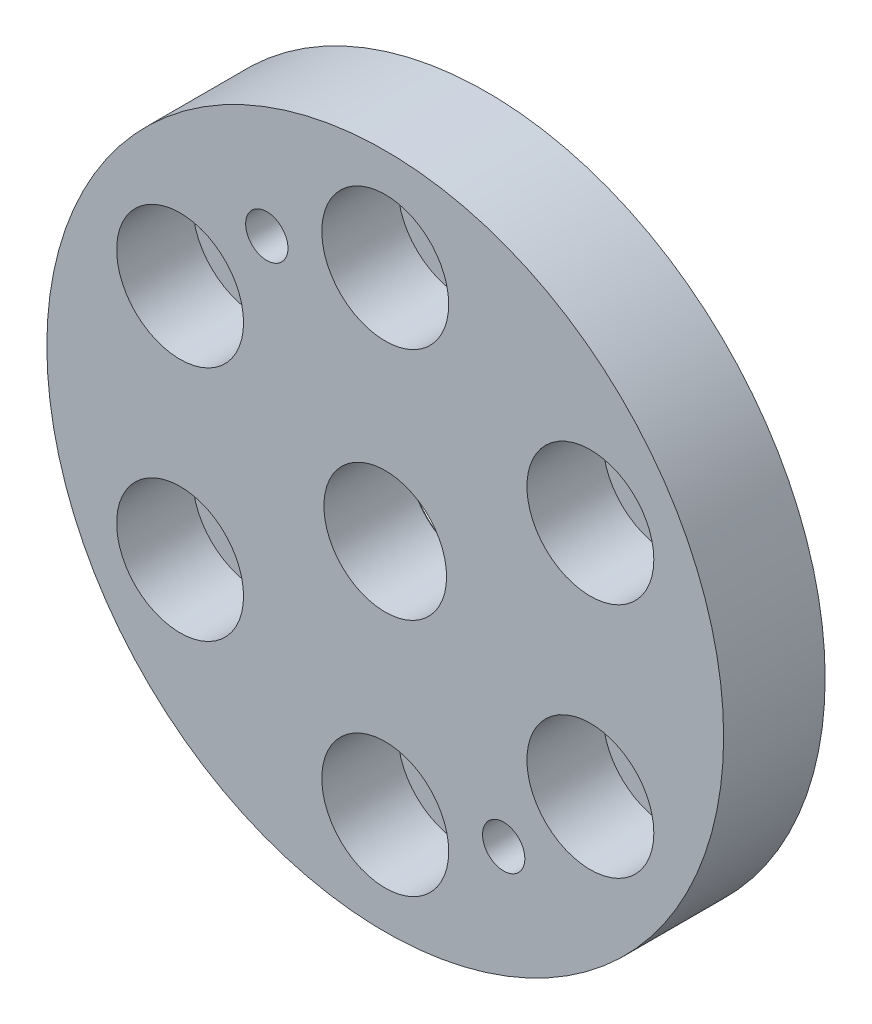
ISO-10303-21;
HEADER;
FILE_DESCRIPTION(('STEP AP214'),'2;1');
FILE_NAME('part.step','',(''),(''),'','','');
FILE_SCHEMA(('AUTOMOTIVE_DESIGN { 1 0 10303 214 1 1 1 1 }'));
ENDSEC;
DATA;
#1=APPLICATION_CONTEXT('core data for automotive mechanical design processes');
#2=APPLICATION_PROTOCOL_DEFINITION('international standard','automotive_design',2000,#1);
#3=PRODUCT_CONTEXT('',#1,'mechanical');
#4=PRODUCT('Part','Part','',(#3));
#5=PRODUCT_RELATED_PRODUCT_CATEGORY('part','',(#4));
#6=PRODUCT_DEFINITION_FORMATION('','',#4);
#7=PRODUCT_DEFINITION_CONTEXT('part definition',#1,'design');
#8=PRODUCT_DEFINITION('design','',#6,#7);
#9=PRODUCT_DEFINITION_SHAPE('','',#8);
#10=(LENGTH_UNIT() NAMED_UNIT(*) SI_UNIT(.MILLI.,.METRE.));
#11=(NAMED_UNIT(*) PLANE_ANGLE_UNIT() SI_UNIT($,.RADIAN.));
#12=(NAMED_UNIT(*) SI_UNIT($,.STERADIAN.) SOLID_ANGLE_UNIT());
#13=UNCERTAINTY_MEASURE_WITH_UNIT(LENGTH_MEASURE(1.E-05),#10,'distance_accuracy_value','');
#14=(GEOMETRIC_REPRESENTATION_CONTEXT(3) GLOBAL_UNCERTAINTY_ASSIGNED_CONTEXT((#13)) GLOBAL_UNIT_ASSIGNED_CONTEXT((#10,
#11,#12)) REPRESENTATION_CONTEXT('',''));
#15=CARTESIAN_POINT('',(0.,0.,0.));
#16=DIRECTION('',(0.,0.,1.));
#17=DIRECTION('',(1.,0.,0.));
#18=AXIS2_PLACEMENT_3D('',#15,#16,#17);
#19=CARTESIAN_POINT('',(0.,0.,-12.));
#20=DIRECTION('',(0.,0.,1.));
#21=DIRECTION('',(1.,0.,0.));
#22=AXIS2_PLACEMENT_3D('',#19,#20,#21);
#23=CYLINDRICAL_SURFACE('',#22,10.);
#24=CARTESIAN_POINT('',(0.,0.,-10.));
#25=DIRECTION('',(0.,0.,1.));
#26=DIRECTION('',(1.,0.,0.));
#27=AXIS2_PLACEMENT_3D('',#24,#25,#26);
#28=CIRCLE('',#27,10.);
#29=CARTESIAN_POINT('',(8.5,5.26782687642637,-10.));
#30=VERTEX_POINT('',#29);
#31=CARTESIAN_POINT('',(-8.5,5.26782687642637,-10.));
#32=VERTEX_POINT('',#31);
#33=EDGE_CURVE('E74',#30,#32,#28,.T.);
#34=ORIENTED_EDGE('',*,*,#33,.T.);
#35=DIRECTION('',(0.,0.,1.));
#36=VECTOR('',#35,1.);
#37=CARTESIAN_POINT('',(-8.5,5.26782687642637,-12.));
#38=LINE('',#37,#36);
#39=CARTESIAN_POINT('',(-8.5,5.26782687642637,-12.));
#40=VERTEX_POINT('',#39);
#41=EDGE_CURVE('E59',#40,#32,#38,.T.);
#42=ORIENTED_EDGE('',*,*,#41,.F.);
#43=CARTESIAN_POINT('',(0.,0.,-12.));
#44=DIRECTION('',(0.,0.,1.));
#45=DIRECTION('',(1.,0.,0.));
#46=AXIS2_PLACEMENT_3D('',#43,#44,#45);
#47=CIRCLE('',#46,10.);
#48=CARTESIAN_POINT('',(8.5,5.26782687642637,-12.));
#49=VERTEX_POINT('',#48);
#50=EDGE_CURVE('E84',#49,#40,#47,.T.);
#51=ORIENTED_EDGE('',*,*,#50,.F.);
#52=DIRECTION('',(0.,0.,1.));
#53=VECTOR('',#52,1.);
#54=CARTESIAN_POINT('',(8.5,5.26782687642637,-12.));
#55=LINE('',#54,#53);
#56=EDGE_CURVE('E75',#49,#30,#55,.T.);
#57=ORIENTED_EDGE('',*,*,#56,.T.);
#58=EDGE_LOOP('',(#34,#42,#51,#57));
#59=FACE_BOUND('',#58,.T.);
#60=ADVANCED_FACE('F16',(#59),#23,.F.);
#61=CARTESIAN_POINT('',(8.5,5.26782687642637,-12.));
#62=DIRECTION('',(1.,0.,0.));
#63=DIRECTION('',(0.,1.,0.));
#64=AXIS2_PLACEMENT_3D('',#61,#62,#63);
#65=PLANE('',#64);
#66=DIRECTION('',(0.,1.,0.));
#67=VECTOR('',#66,1.);
#68=CARTESIAN_POINT('',(8.5,-5.26782687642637,-10.));
#69=LINE('',#68,#67);
#70=CARTESIAN_POINT('',(8.5,-5.26782687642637,-10.));
#71=VERTEX_POINT('',#70);
#72=EDGE_CURVE('E33',#71,#30,#69,.T.);
#73=ORIENTED_EDGE('',*,*,#72,.T.);
#74=ORIENTED_EDGE('',*,*,#56,.F.);
#75=DIRECTION('',(0.,1.,0.));
#76=VECTOR('',#75,1.);
#77=CARTESIAN_POINT('',(8.5,5.26782687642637,-12.));
#78=LINE('',#77,#76);
#79=CARTESIAN_POINT('',(8.5,-5.26782687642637,-12.));
#80=VERTEX_POINT('',#79);
#81=EDGE_CURVE('E71',#80,#49,#78,.T.);
#82=ORIENTED_EDGE('',*,*,#81,.F.);
#83=DIRECTION('',(0.,0.,1.));
#84=VECTOR('',#83,1.);
#85=CARTESIAN_POINT('',(8.5,-5.26782687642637,-12.));
#86=LINE('',#85,#84);
#87=EDGE_CURVE('E93',#80,#71,#86,.T.);
#88=ORIENTED_EDGE('',*,*,#87,.T.);
#89=EDGE_LOOP('',(#73,#74,#82,#88));
#90=FACE_BOUND('',#89,.T.);
#91=ADVANCED_FACE('F114',(#90),#65,.F.);
#92=CARTESIAN_POINT('',(0.,0.,-12.));
#93=DIRECTION('',(0.,0.,1.));
#94=DIRECTION('',(1.,0.,0.));
#95=AXIS2_PLACEMENT_3D('',#92,#93,#94);
#96=CYLINDRICAL_SURFACE('',#95,10.);
#97=CARTESIAN_POINT('',(0.,0.,-10.));
#98=DIRECTION('',(0.,0.,1.));
#99=DIRECTION('',(1.,0.,0.));
#100=AXIS2_PLACEMENT_3D('',#97,#98,#99);
#101=CIRCLE('',#100,10.);
#102=CARTESIAN_POINT('',(-8.5,-5.26782687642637,-10.));
#103=VERTEX_POINT('',#102);
#104=EDGE_CURVE('E41',#103,#71,#101,.T.);
#105=ORIENTED_EDGE('',*,*,#104,.T.);
#106=ORIENTED_EDGE('',*,*,#87,.F.);
#107=CARTESIAN_POINT('',(0.,0.,-12.));
#108=DIRECTION('',(0.,0.,1.));
#109=DIRECTION('',(1.,0.,0.));
#110=AXIS2_PLACEMENT_3D('',#107,#108,#109);
#111=CIRCLE('',#110,10.);
#112=CARTESIAN_POINT('',(-8.5,-5.26782687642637,-12.));
#113=VERTEX_POINT('',#112);
#114=EDGE_CURVE('E87',#113,#80,#111,.T.);
#115=ORIENTED_EDGE('',*,*,#114,.F.);
#116=DIRECTION('',(0.,0.,1.));
#117=VECTOR('',#116,1.);
#118=CARTESIAN_POINT('',(-8.5,-5.26782687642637,-12.));
#119=LINE('',#118,#117);
#120=EDGE_CURVE('E70',#113,#103,#119,.T.);
#121=ORIENTED_EDGE('',*,*,#120,.T.);
#122=EDGE_LOOP('',(#105,#106,#115,#121));
#123=FACE_BOUND('',#122,.T.);
#124=ADVANCED_FACE('F111',(#123),#96,.F.);
#125=CARTESIAN_POINT('',(-8.5,-5.26782687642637,-12.));
#126=DIRECTION('',(-1.,0.,0.));
#127=DIRECTION('',(0.,0.,1.));
#128=AXIS2_PLACEMENT_3D('',#125,#126,#127);
#129=PLANE('',#128);
#130=DIRECTION('',(0.,-1.,0.));
#131=VECTOR('',#130,1.);
#132=CARTESIAN_POINT('',(-8.5,5.26782687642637,-10.));
#133=LINE('',#132,#131);
#134=EDGE_CURVE('E64',#32,#103,#133,.T.);
#135=ORIENTED_EDGE('',*,*,#134,.T.);
#136=ORIENTED_EDGE('',*,*,#120,.F.);
#137=DIRECTION('',(0.,-1.,0.));
#138=VECTOR('',#137,1.);
#139=CARTESIAN_POINT('',(-8.5,-5.26782687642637,-12.));
#140=LINE('',#139,#138);
#141=EDGE_CURVE('E66',#40,#113,#140,.T.);
#142=ORIENTED_EDGE('',*,*,#141,.F.);
#143=ORIENTED_EDGE('',*,*,#41,.T.);
#144=EDGE_LOOP('',(#135,#136,#142,#143));
#145=FACE_BOUND('',#144,.T.);
#146=ADVANCED_FACE('F61',(#145),#129,.F.);
#147=CARTESIAN_POINT('',(0.,0.,-12.));
#148=DIRECTION('',(0.,0.,1.));
#149=DIRECTION('',(1.,0.,0.));
#150=AXIS2_PLACEMENT_3D('',#147,#148,#149);
#151=CYLINDRICAL_SURFACE('',#150,40.);
#152=CARTESIAN_POINT('',(0.,0.,-12.));
#153=DIRECTION('',(0.,0.,1.));
#154=DIRECTION('',(1.,0.,0.));
#155=AXIS2_PLACEMENT_3D('',#152,#153,#154);
#156=CIRCLE('',#155,40.);
#157=CARTESIAN_POINT('',(40.,0.,-12.));
#158=VERTEX_POINT('',#157);
#159=EDGE_CURVE('E11',#158,#158,#156,.T.);
#160=ORIENTED_EDGE('',*,*,#159,.T.);
#161=EDGE_LOOP('',(#160));
#162=FACE_BOUND('',#161,.T.);
#163=CARTESIAN_POINT('',(0.,0.,0.));
#164=DIRECTION('',(0.,0.,1.));
#165=DIRECTION('',(1.,0.,0.));
#166=AXIS2_PLACEMENT_3D('',#163,#164,#165);
#167=CIRCLE('',#166,40.);
#168=CARTESIAN_POINT('',(40.,0.,0.));
#169=VERTEX_POINT('',#168);
#170=EDGE_CURVE('E25',#169,#169,#167,.T.);
#171=ORIENTED_EDGE('',*,*,#170,.F.);
#172=EDGE_LOOP('',(#171));
#173=FACE_BOUND('',#172,.T.);
#174=ADVANCED_FACE('F18',(#162,#173),#151,.T.);
#175=CARTESIAN_POINT('',(0.,0.,-12.));
#176=DIRECTION('',(0.,0.,1.));
#177=DIRECTION('',(1.,0.,0.));
#178=AXIS2_PLACEMENT_3D('',#175,#176,#177);
#179=PLANE('',#178);
#180=CARTESIAN_POINT('',(-14.,24.2487113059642,-12.));
#181=DIRECTION('',(0.,0.,1.));
#182=DIRECTION('',(1.,0.,0.));
#183=AXIS2_PLACEMENT_3D('',#180,#181,#182);
#184=CIRCLE('',#183,2.5);
#185=CARTESIAN_POINT('',(-11.5,24.2487113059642,-12.));
#186=VERTEX_POINT('',#185);
#187=EDGE_CURVE('E233',#186,#186,#184,.T.);
#188=ORIENTED_EDGE('',*,*,#187,.T.);
#189=EDGE_LOOP('',(#188));
#190=FACE_BOUND('',#189,.T.);
#191=CARTESIAN_POINT('',(14.,-24.2487113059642,-12.));
#192=DIRECTION('',(0.,0.,1.));
#193=DIRECTION('',(1.,0.,0.));
#194=AXIS2_PLACEMENT_3D('',#191,#192,#193);
#195=CIRCLE('',#194,2.5);
#196=CARTESIAN_POINT('',(16.5,-24.2487113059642,-12.));
#197=VERTEX_POINT('',#196);
#198=EDGE_CURVE('E229',#197,#197,#195,.T.);
#199=ORIENTED_EDGE('',*,*,#198,.T.);
#200=EDGE_LOOP('',(#199));
#201=FACE_BOUND('',#200,.T.);
#202=CARTESIAN_POINT('',(0.,28.,-12.));
#203=DIRECTION('',(0.,0.,1.));
#204=DIRECTION('',(1.,0.,0.));
#205=AXIS2_PLACEMENT_3D('',#202,#203,#204);
#206=CIRCLE('',#205,4.5);
#207=CARTESIAN_POINT('',(4.5,28.,-12.));
#208=VERTEX_POINT('',#207);
#209=EDGE_CURVE('E219',#208,#208,#206,.T.);
#210=ORIENTED_EDGE('',*,*,#209,.T.);
#211=EDGE_LOOP('',(#210));
#212=FACE_BOUND('',#211,.T.);
#213=CARTESIAN_POINT('',(24.2487113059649,14.000000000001,-12.));
#214=DIRECTION('',(0.,0.,1.));
#215=DIRECTION('',(1.,0.,0.));
#216=AXIS2_PLACEMENT_3D('',#213,#214,#215);
#217=CIRCLE('',#216,4.5);
#218=CARTESIAN_POINT('',(28.7487113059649,14.000000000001,-12.));
#219=VERTEX_POINT('',#218);
#220=EDGE_CURVE('E209',#219,#219,#217,.T.);
#221=ORIENTED_EDGE('',*,*,#220,.T.);
#222=EDGE_LOOP('',(#221));
#223=FACE_BOUND('',#222,.T.);
#224=CARTESIAN_POINT('',(24.2487113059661,-13.999999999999,-12.));
#225=DIRECTION('',(0.,0.,1.));
#226=DIRECTION('',(1.,0.,0.));
#227=AXIS2_PLACEMENT_3D('',#224,#225,#226);
#228=CIRCLE('',#227,4.5);
#229=CARTESIAN_POINT('',(28.7487113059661,-13.999999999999,-12.));
#230=VERTEX_POINT('',#229);
#231=EDGE_CURVE('E199',#230,#230,#228,.T.);
#232=ORIENTED_EDGE('',*,*,#231,.T.);
#233=EDGE_LOOP('',(#232));
#234=FACE_BOUND('',#233,.T.);
#235=CARTESIAN_POINT('',(2.38056557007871E-12,-28.,-12.));
#236=DIRECTION('',(0.,0.,1.));
#237=DIRECTION('',(1.,0.,0.));
#238=AXIS2_PLACEMENT_3D('',#235,#236,#237);
#239=CIRCLE('',#238,4.5);
#240=CARTESIAN_POINT('',(4.50000000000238,-28.,-12.));
#241=VERTEX_POINT('',#240);
#242=EDGE_CURVE('E189',#241,#241,#239,.T.);
#243=ORIENTED_EDGE('',*,*,#242,.T.);
#244=EDGE_LOOP('',(#243));
#245=FACE_BOUND('',#244,.T.);
#246=CARTESIAN_POINT('',(-24.2487113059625,-14.000000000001,-12.));
#247=DIRECTION('',(0.,0.,1.));
#248=DIRECTION('',(1.,0.,0.));
#249=AXIS2_PLACEMENT_3D('',#246,#247,#248);
#250=CIRCLE('',#249,4.5);
#251=CARTESIAN_POINT('',(-19.7487113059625,-14.000000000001,-12.));
#252=VERTEX_POINT('',#251);
#253=EDGE_CURVE('E179',#252,#252,#250,.T.);
#254=ORIENTED_EDGE('',*,*,#253,.T.);
#255=EDGE_LOOP('',(#254));
#256=FACE_BOUND('',#255,.T.);
#257=CARTESIAN_POINT('',(-24.2487113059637,13.999999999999,-12.));
#258=DIRECTION('',(0.,0.,1.));
#259=DIRECTION('',(1.,0.,0.));
#260=AXIS2_PLACEMENT_3D('',#257,#258,#259);
#261=CIRCLE('',#260,4.5);
#262=CARTESIAN_POINT('',(-19.7487113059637,13.999999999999,-12.));
#263=VERTEX_POINT('',#262);
#264=EDGE_CURVE('E167',#263,#263,#261,.T.);
#265=ORIENTED_EDGE('',*,*,#264,.T.);
#266=EDGE_LOOP('',(#265));
#267=FACE_BOUND('',#266,.T.);
#268=ORIENTED_EDGE('',*,*,#81,.T.);
#269=ORIENTED_EDGE('',*,*,#50,.T.);
#270=ORIENTED_EDGE('',*,*,#141,.T.);
#271=ORIENTED_EDGE('',*,*,#114,.T.);
#272=EDGE_LOOP('',(#268,#269,#270,#271));
#273=FACE_BOUND('',#272,.T.);
#274=ORIENTED_EDGE('',*,*,#159,.F.);
#275=EDGE_LOOP('',(#274));
#276=FACE_BOUND('',#275,.T.);
#277=ADVANCED_FACE('F101',(#190,#201,#212,#223,#234,#245,#256,#267,#273,#276),#179,.F.);
#278=CARTESIAN_POINT('',(0.,0.,0.));
#279=DIRECTION('',(0.,0.,1.));
#280=DIRECTION('',(1.,0.,0.));
#281=AXIS2_PLACEMENT_3D('',#278,#279,#280);
#282=PLANE('',#281);
#283=CARTESIAN_POINT('',(-14.,24.2487113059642,0.));
#284=DIRECTION('',(0.,0.,1.));
#285=DIRECTION('',(1.,0.,0.));
#286=AXIS2_PLACEMENT_3D('',#283,#284,#285);
#287=CIRCLE('',#286,2.5);
#288=CARTESIAN_POINT('',(-11.5,24.2487113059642,0.));
#289=VERTEX_POINT('',#288);
#290=EDGE_CURVE('E134',#289,#289,#287,.T.);
#291=ORIENTED_EDGE('',*,*,#290,.F.);
#292=EDGE_LOOP('',(#291));
#293=FACE_BOUND('',#292,.T.);
#294=CARTESIAN_POINT('',(14.,-24.2487113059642,0.));
#295=DIRECTION('',(0.,0.,1.));
#296=DIRECTION('',(1.,0.,0.));
#297=AXIS2_PLACEMENT_3D('',#294,#295,#296);
#298=CIRCLE('',#297,2.5);
#299=CARTESIAN_POINT('',(16.5,-24.2487113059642,0.));
#300=VERTEX_POINT('',#299);
#301=EDGE_CURVE('E138',#300,#300,#298,.T.);
#302=ORIENTED_EDGE('',*,*,#301,.F.);
#303=EDGE_LOOP('',(#302));
#304=FACE_BOUND('',#303,.T.);
#305=CARTESIAN_POINT('',(0.,28.,0.));
#306=DIRECTION('',(0.,0.,1.));
#307=DIRECTION('',(1.,0.,0.));
#308=AXIS2_PLACEMENT_3D('',#305,#306,#307);
#309=CIRCLE('',#308,7.5);
#310=CARTESIAN_POINT('',(7.5,28.,0.));
#311=VERTEX_POINT('',#310);
#312=EDGE_CURVE('E142',#311,#311,#309,.T.);
#313=ORIENTED_EDGE('',*,*,#312,.F.);
#314=EDGE_LOOP('',(#313));
#315=FACE_BOUND('',#314,.T.);
#316=CARTESIAN_POINT('',(24.2487113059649,14.000000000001,0.));
#317=DIRECTION('',(0.,0.,1.));
#318=DIRECTION('',(1.,0.,0.));
#319=AXIS2_PLACEMENT_3D('',#316,#317,#318);
#320=CIRCLE('',#319,7.5);
#321=CARTESIAN_POINT('',(31.7487113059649,14.000000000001,0.));
#322=VERTEX_POINT('',#321);
#323=EDGE_CURVE('E146',#322,#322,#320,.T.);
#324=ORIENTED_EDGE('',*,*,#323,.F.);
#325=EDGE_LOOP('',(#324));
#326=FACE_BOUND('',#325,.T.);
#327=CARTESIAN_POINT('',(24.2487113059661,-13.999999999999,0.));
#328=DIRECTION('',(0.,0.,1.));
#329=DIRECTION('',(1.,0.,0.));
#330=AXIS2_PLACEMENT_3D('',#327,#328,#329);
#331=CIRCLE('',#330,7.5);
#332=CARTESIAN_POINT('',(31.7487113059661,-13.999999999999,0.));
#333=VERTEX_POINT('',#332);
#334=EDGE_CURVE('E150',#333,#333,#331,.T.);
#335=ORIENTED_EDGE('',*,*,#334,.F.);
#336=EDGE_LOOP('',(#335));
#337=FACE_BOUND('',#336,.T.);
#338=CARTESIAN_POINT('',(2.38056557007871E-12,-28.,0.));
#339=DIRECTION('',(0.,0.,1.));
#340=DIRECTION('',(1.,0.,0.));
#341=AXIS2_PLACEMENT_3D('',#338,#339,#340);
#342=CIRCLE('',#341,7.5);
#343=CARTESIAN_POINT('',(7.50000000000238,-28.,0.));
#344=VERTEX_POINT('',#343);
#345=EDGE_CURVE('E154',#344,#344,#342,.T.);
#346=ORIENTED_EDGE('',*,*,#345,.F.);
#347=EDGE_LOOP('',(#346));
#348=FACE_BOUND('',#347,.T.);
#349=CARTESIAN_POINT('',(-24.2487113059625,-14.000000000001,0.));
#350=DIRECTION('',(0.,0.,1.));
#351=DIRECTION('',(1.,0.,0.));
#352=AXIS2_PLACEMENT_3D('',#349,#350,#351);
#353=CIRCLE('',#352,7.5);
#354=CARTESIAN_POINT('',(-16.7487113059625,-14.000000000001,0.));
#355=VERTEX_POINT('',#354);
#356=EDGE_CURVE('E158',#355,#355,#353,.T.);
#357=ORIENTED_EDGE('',*,*,#356,.F.);
#358=EDGE_LOOP('',(#357));
#359=FACE_BOUND('',#358,.T.);
#360=CARTESIAN_POINT('',(-24.2487113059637,13.999999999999,0.));
#361=DIRECTION('',(0.,0.,1.));
#362=DIRECTION('',(1.,0.,0.));
#363=AXIS2_PLACEMENT_3D('',#360,#361,#362);
#364=CIRCLE('',#363,7.5);
#365=CARTESIAN_POINT('',(-16.7487113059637,13.999999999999,0.));
#366=VERTEX_POINT('',#365);
#367=EDGE_CURVE('E162',#366,#366,#364,.T.);
#368=ORIENTED_EDGE('',*,*,#367,.F.);
#369=EDGE_LOOP('',(#368));
#370=FACE_BOUND('',#369,.T.);
#371=CARTESIAN_POINT('',(0.,0.,0.));
#372=DIRECTION('',(0.,0.,1.));
#373=DIRECTION('',(1.,0.,0.));
#374=AXIS2_PLACEMENT_3D('',#371,#372,#373);
#375=CIRCLE('',#374,7.25);
#376=CARTESIAN_POINT('',(7.25,0.,0.));
#377=VERTEX_POINT('',#376);
#378=EDGE_CURVE('E165',#377,#377,#375,.T.);
#379=ORIENTED_EDGE('',*,*,#378,.F.);
#380=EDGE_LOOP('',(#379));
#381=FACE_BOUND('',#380,.T.);
#382=ORIENTED_EDGE('',*,*,#170,.T.);
#383=EDGE_LOOP('',(#382));
#384=FACE_BOUND('',#383,.T.);
#385=ADVANCED_FACE('F98',(#293,#304,#315,#326,#337,#348,#359,#370,#381,#384),#282,.T.);
#386=CARTESIAN_POINT('',(0.,0.,-10.));
#387=DIRECTION('',(0.,0.,1.));
#388=DIRECTION('',(1.,0.,0.));
#389=AXIS2_PLACEMENT_3D('',#386,#387,#388);
#390=PLANE('',#389);
#391=CARTESIAN_POINT('',(0.,0.,-10.));
#392=DIRECTION('',(0.,0.,1.));
#393=DIRECTION('',(1.,0.,0.));
#394=AXIS2_PLACEMENT_3D('',#391,#392,#393);
#395=CIRCLE('',#394,7.25);
#396=CARTESIAN_POINT('',(7.25,0.,-10.));
#397=VERTEX_POINT('',#396);
#398=EDGE_CURVE('E20',#397,#397,#395,.T.);
#399=ORIENTED_EDGE('',*,*,#398,.T.);
#400=EDGE_LOOP('',(#399));
#401=FACE_BOUND('',#400,.T.);
#402=ORIENTED_EDGE('',*,*,#33,.F.);
#403=ORIENTED_EDGE('',*,*,#72,.F.);
#404=ORIENTED_EDGE('',*,*,#104,.F.);
#405=ORIENTED_EDGE('',*,*,#134,.F.);
#406=EDGE_LOOP('',(#402,#403,#404,#405));
#407=FACE_BOUND('',#406,.T.);
#408=ADVANCED_FACE('F78',(#401,#407),#390,.F.);
#409=CARTESIAN_POINT('',(0.,0.,0.));
#410=DIRECTION('',(0.,0.,1.));
#411=DIRECTION('',(1.,0.,0.));
#412=AXIS2_PLACEMENT_3D('',#409,#410,#411);
#413=CYLINDRICAL_SURFACE('',#412,7.25);
#414=ORIENTED_EDGE('',*,*,#378,.T.);
#415=EDGE_LOOP('',(#414));
#416=FACE_BOUND('',#415,.T.);
#417=ORIENTED_EDGE('',*,*,#398,.F.);
#418=EDGE_LOOP('',(#417));
#419=FACE_BOUND('',#418,.T.);
#420=ADVANCED_FACE('F128',(#416,#419),#413,.F.);
#421=CARTESIAN_POINT('',(-24.2487113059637,13.999999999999,0.));
#422=DIRECTION('',(0.,0.,1.));
#423=DIRECTION('',(1.,0.,0.));
#424=AXIS2_PLACEMENT_3D('',#421,#422,#423);
#425=CYLINDRICAL_SURFACE('',#424,4.5);
#426=ORIENTED_EDGE('',*,*,#264,.F.);
#427=EDGE_LOOP('',(#426));
#428=FACE_BOUND('',#427,.T.);
#429=CARTESIAN_POINT('',(-24.2487113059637,13.999999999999,-9.));
#430=DIRECTION('',(0.,0.,1.));
#431=DIRECTION('',(1.,0.,0.));
#432=AXIS2_PLACEMENT_3D('',#429,#430,#431);
#433=CIRCLE('',#432,4.5);
#434=CARTESIAN_POINT('',(-19.7487113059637,13.999999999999,-9.));
#435=VERTEX_POINT('',#434);
#436=EDGE_CURVE('E170',#435,#435,#433,.T.);
#437=ORIENTED_EDGE('',*,*,#436,.T.);
#438=EDGE_LOOP('',(#437));
#439=FACE_BOUND('',#438,.T.);
#440=ADVANCED_FACE('F317',(#428,#439),#425,.F.);
#441=CARTESIAN_POINT('',(-19.7487113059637,13.999999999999,-9.));
#442=DIRECTION('',(0.,0.,-1.));
#443=DIRECTION('',(-1.,0.,0.));
#444=AXIS2_PLACEMENT_3D('',#441,#442,#443);
#445=PLANE('',#444);
#446=ORIENTED_EDGE('',*,*,#436,.F.);
#447=EDGE_LOOP('',(#446));
#448=FACE_BOUND('',#447,.T.);
#449=CARTESIAN_POINT('',(-24.2487113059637,13.999999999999,-9.));
#450=DIRECTION('',(0.,0.,1.));
#451=DIRECTION('',(1.,0.,0.));
#452=AXIS2_PLACEMENT_3D('',#449,#450,#451);
#453=CIRCLE('',#452,7.5);
#454=CARTESIAN_POINT('',(-16.7487113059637,13.999999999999,-9.));
#455=VERTEX_POINT('',#454);
#456=EDGE_CURVE('E175',#455,#455,#453,.T.);
#457=ORIENTED_EDGE('',*,*,#456,.T.);
#458=EDGE_LOOP('',(#457));
#459=FACE_BOUND('',#458,.T.);
#460=ADVANCED_FACE('F313',(#448,#459),#445,.F.);
#461=CARTESIAN_POINT('',(-24.2487113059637,13.999999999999,0.));
#462=DIRECTION('',(0.,0.,1.));
#463=DIRECTION('',(1.,0.,0.));
#464=AXIS2_PLACEMENT_3D('',#461,#462,#463);
#465=CYLINDRICAL_SURFACE('',#464,7.5);
#466=ORIENTED_EDGE('',*,*,#456,.F.);
#467=EDGE_LOOP('',(#466));
#468=FACE_BOUND('',#467,.T.);
#469=ORIENTED_EDGE('',*,*,#367,.T.);
#470=EDGE_LOOP('',(#469));
#471=FACE_BOUND('',#470,.T.);
#472=ADVANCED_FACE('F309',(#468,#471),#465,.F.);
#473=CARTESIAN_POINT('',(-24.2487113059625,-14.000000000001,0.));
#474=DIRECTION('',(0.,0.,1.));
#475=DIRECTION('',(1.,0.,0.));
#476=AXIS2_PLACEMENT_3D('',#473,#474,#475);
#477=CYLINDRICAL_SURFACE('',#476,4.5);
#478=ORIENTED_EDGE('',*,*,#253,.F.);
#479=EDGE_LOOP('',(#478));
#480=FACE_BOUND('',#479,.T.);
#481=CARTESIAN_POINT('',(-24.2487113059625,-14.000000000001,-9.));
#482=DIRECTION('',(0.,0.,1.));
#483=DIRECTION('',(1.,0.,0.));
#484=AXIS2_PLACEMENT_3D('',#481,#482,#483);
#485=CIRCLE('',#484,4.5);
#486=CARTESIAN_POINT('',(-19.7487113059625,-14.000000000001,-9.));
#487=VERTEX_POINT('',#486);
#488=EDGE_CURVE('E182',#487,#487,#485,.T.);
#489=ORIENTED_EDGE('',*,*,#488,.T.);
#490=EDGE_LOOP('',(#489));
#491=FACE_BOUND('',#490,.T.);
#492=ADVANCED_FACE('F305',(#480,#491),#477,.F.);
#493=CARTESIAN_POINT('',(-19.7487113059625,-14.000000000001,-9.));
#494=DIRECTION('',(0.,0.,-1.));
#495=DIRECTION('',(-1.,0.,0.));
#496=AXIS2_PLACEMENT_3D('',#493,#494,#495);
#497=PLANE('',#496);
#498=ORIENTED_EDGE('',*,*,#488,.F.);
#499=EDGE_LOOP('',(#498));
#500=FACE_BOUND('',#499,.T.);
#501=CARTESIAN_POINT('',(-24.2487113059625,-14.000000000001,-9.));
#502=DIRECTION('',(0.,0.,1.));
#503=DIRECTION('',(1.,0.,0.));
#504=AXIS2_PLACEMENT_3D('',#501,#502,#503);
#505=CIRCLE('',#504,7.5);
#506=CARTESIAN_POINT('',(-16.7487113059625,-14.000000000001,-9.));
#507=VERTEX_POINT('',#506);
#508=EDGE_CURVE('E185',#507,#507,#505,.T.);
#509=ORIENTED_EDGE('',*,*,#508,.T.);
#510=EDGE_LOOP('',(#509));
#511=FACE_BOUND('',#510,.T.);
#512=ADVANCED_FACE('F301',(#500,#511),#497,.F.);
#513=CARTESIAN_POINT('',(-24.2487113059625,-14.000000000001,0.));
#514=DIRECTION('',(0.,0.,1.));
#515=DIRECTION('',(1.,0.,0.));
#516=AXIS2_PLACEMENT_3D('',#513,#514,#515);
#517=CYLINDRICAL_SURFACE('',#516,7.5);
#518=ORIENTED_EDGE('',*,*,#508,.F.);
#519=EDGE_LOOP('',(#518));
#520=FACE_BOUND('',#519,.T.);
#521=ORIENTED_EDGE('',*,*,#356,.T.);
#522=EDGE_LOOP('',(#521));
#523=FACE_BOUND('',#522,.T.);
#524=ADVANCED_FACE('F297',(#520,#523),#517,.F.);
#525=CARTESIAN_POINT('',(2.38056557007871E-12,-28.,0.));
#526=DIRECTION('',(0.,0.,1.));
#527=DIRECTION('',(1.,0.,0.));
#528=AXIS2_PLACEMENT_3D('',#525,#526,#527);
#529=CYLINDRICAL_SURFACE('',#528,4.5);
#530=ORIENTED_EDGE('',*,*,#242,.F.);
#531=EDGE_LOOP('',(#530));
#532=FACE_BOUND('',#531,.T.);
#533=CARTESIAN_POINT('',(2.38056557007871E-12,-28.,-9.));
#534=DIRECTION('',(0.,0.,1.));
#535=DIRECTION('',(1.,0.,0.));
#536=AXIS2_PLACEMENT_3D('',#533,#534,#535);
#537=CIRCLE('',#536,4.5);
#538=CARTESIAN_POINT('',(4.50000000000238,-28.,-9.));
#539=VERTEX_POINT('',#538);
#540=EDGE_CURVE('E192',#539,#539,#537,.T.);
#541=ORIENTED_EDGE('',*,*,#540,.T.);
#542=EDGE_LOOP('',(#541));
#543=FACE_BOUND('',#542,.T.);
#544=ADVANCED_FACE('F293',(#532,#543),#529,.F.);
#545=CARTESIAN_POINT('',(4.50000000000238,-28.,-9.));
#546=DIRECTION('',(0.,0.,-1.));
#547=DIRECTION('',(-1.,0.,0.));
#548=AXIS2_PLACEMENT_3D('',#545,#546,#547);
#549=PLANE('',#548);
#550=ORIENTED_EDGE('',*,*,#540,.F.);
#551=EDGE_LOOP('',(#550));
#552=FACE_BOUND('',#551,.T.);
#553=CARTESIAN_POINT('',(2.38056557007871E-12,-28.,-9.));
#554=DIRECTION('',(0.,0.,1.));
#555=DIRECTION('',(1.,0.,0.));
#556=AXIS2_PLACEMENT_3D('',#553,#554,#555);
#557=CIRCLE('',#556,7.5);
#558=CARTESIAN_POINT('',(7.50000000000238,-28.,-9.));
#559=VERTEX_POINT('',#558);
#560=EDGE_CURVE('E195',#559,#559,#557,.T.);
#561=ORIENTED_EDGE('',*,*,#560,.T.);
#562=EDGE_LOOP('',(#561));
#563=FACE_BOUND('',#562,.T.);
#564=ADVANCED_FACE('F289',(#552,#563),#549,.F.);
#565=CARTESIAN_POINT('',(2.38056557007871E-12,-28.,0.));
#566=DIRECTION('',(0.,0.,1.));
#567=DIRECTION('',(1.,0.,0.));
#568=AXIS2_PLACEMENT_3D('',#565,#566,#567);
#569=CYLINDRICAL_SURFACE('',#568,7.5);
#570=ORIENTED_EDGE('',*,*,#560,.F.);
#571=EDGE_LOOP('',(#570));
#572=FACE_BOUND('',#571,.T.);
#573=ORIENTED_EDGE('',*,*,#345,.T.);
#574=EDGE_LOOP('',(#573));
#575=FACE_BOUND('',#574,.T.);
#576=ADVANCED_FACE('F285',(#572,#575),#569,.F.);
#577=CARTESIAN_POINT('',(24.2487113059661,-13.999999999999,0.));
#578=DIRECTION('',(0.,0.,1.));
#579=DIRECTION('',(1.,0.,0.));
#580=AXIS2_PLACEMENT_3D('',#577,#578,#579);
#581=CYLINDRICAL_SURFACE('',#580,4.5);
#582=ORIENTED_EDGE('',*,*,#231,.F.);
#583=EDGE_LOOP('',(#582));
#584=FACE_BOUND('',#583,.T.);
#585=CARTESIAN_POINT('',(24.2487113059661,-13.999999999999,-9.));
#586=DIRECTION('',(0.,0.,1.));
#587=DIRECTION('',(1.,0.,0.));
#588=AXIS2_PLACEMENT_3D('',#585,#586,#587);
#589=CIRCLE('',#588,4.5);
#590=CARTESIAN_POINT('',(28.7487113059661,-13.999999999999,-9.));
#591=VERTEX_POINT('',#590);
#592=EDGE_CURVE('E202',#591,#591,#589,.T.);
#593=ORIENTED_EDGE('',*,*,#592,.T.);
#594=EDGE_LOOP('',(#593));
#595=FACE_BOUND('',#594,.T.);
#596=ADVANCED_FACE('F281',(#584,#595),#581,.F.);
#597=CARTESIAN_POINT('',(28.7487113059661,-13.999999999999,-9.));
#598=DIRECTION('',(0.,0.,-1.));
#599=DIRECTION('',(-1.,0.,0.));
#600=AXIS2_PLACEMENT_3D('',#597,#598,#599);
#601=PLANE('',#600);
#602=ORIENTED_EDGE('',*,*,#592,.F.);
#603=EDGE_LOOP('',(#602));
#604=FACE_BOUND('',#603,.T.);
#605=CARTESIAN_POINT('',(24.2487113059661,-13.999999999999,-9.));
#606=DIRECTION('',(0.,0.,1.));
#607=DIRECTION('',(1.,0.,0.));
#608=AXIS2_PLACEMENT_3D('',#605,#606,#607);
#609=CIRCLE('',#608,7.5);
#610=CARTESIAN_POINT('',(31.7487113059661,-13.999999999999,-9.));
#611=VERTEX_POINT('',#610);
#612=EDGE_CURVE('E205',#611,#611,#609,.T.);
#613=ORIENTED_EDGE('',*,*,#612,.T.);
#614=EDGE_LOOP('',(#613));
#615=FACE_BOUND('',#614,.T.);
#616=ADVANCED_FACE('F277',(#604,#615),#601,.F.);
#617=CARTESIAN_POINT('',(24.2487113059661,-13.999999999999,0.));
#618=DIRECTION('',(0.,0.,1.));
#619=DIRECTION('',(1.,0.,0.));
#620=AXIS2_PLACEMENT_3D('',#617,#618,#619);
#621=CYLINDRICAL_SURFACE('',#620,7.5);
#622=ORIENTED_EDGE('',*,*,#612,.F.);
#623=EDGE_LOOP('',(#622));
#624=FACE_BOUND('',#623,.T.);
#625=ORIENTED_EDGE('',*,*,#334,.T.);
#626=EDGE_LOOP('',(#625));
#627=FACE_BOUND('',#626,.T.);
#628=ADVANCED_FACE('F273',(#624,#627),#621,.F.);
#629=CARTESIAN_POINT('',(24.2487113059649,14.000000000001,0.));
#630=DIRECTION('',(0.,0.,1.));
#631=DIRECTION('',(1.,0.,0.));
#632=AXIS2_PLACEMENT_3D('',#629,#630,#631);
#633=CYLINDRICAL_SURFACE('',#632,4.5);
#634=ORIENTED_EDGE('',*,*,#220,.F.);
#635=EDGE_LOOP('',(#634));
#636=FACE_BOUND('',#635,.T.);
#637=CARTESIAN_POINT('',(24.2487113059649,14.000000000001,-9.));
#638=DIRECTION('',(0.,0.,1.));
#639=DIRECTION('',(1.,0.,0.));
#640=AXIS2_PLACEMENT_3D('',#637,#638,#639);
#641=CIRCLE('',#640,4.5);
#642=CARTESIAN_POINT('',(28.7487113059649,14.000000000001,-9.));
#643=VERTEX_POINT('',#642);
#644=EDGE_CURVE('E212',#643,#643,#641,.T.);
#645=ORIENTED_EDGE('',*,*,#644,.T.);
#646=EDGE_LOOP('',(#645));
#647=FACE_BOUND('',#646,.T.);
#648=ADVANCED_FACE('F269',(#636,#647),#633,.F.);
#649=CARTESIAN_POINT('',(28.7487113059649,14.000000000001,-9.));
#650=DIRECTION('',(0.,0.,-1.));
#651=DIRECTION('',(-1.,0.,0.));
#652=AXIS2_PLACEMENT_3D('',#649,#650,#651);
#653=PLANE('',#652);
#654=ORIENTED_EDGE('',*,*,#644,.F.);
#655=EDGE_LOOP('',(#654));
#656=FACE_BOUND('',#655,.T.);
#657=CARTESIAN_POINT('',(24.2487113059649,14.000000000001,-9.));
#658=DIRECTION('',(0.,0.,1.));
#659=DIRECTION('',(1.,0.,0.));
#660=AXIS2_PLACEMENT_3D('',#657,#658,#659);
#661=CIRCLE('',#660,7.5);
#662=CARTESIAN_POINT('',(31.7487113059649,14.000000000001,-9.));
#663=VERTEX_POINT('',#662);
#664=EDGE_CURVE('E215',#663,#663,#661,.T.);
#665=ORIENTED_EDGE('',*,*,#664,.T.);
#666=EDGE_LOOP('',(#665));
#667=FACE_BOUND('',#666,.T.);
#668=ADVANCED_FACE('F265',(#656,#667),#653,.F.);
#669=CARTESIAN_POINT('',(24.2487113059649,14.000000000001,0.));
#670=DIRECTION('',(0.,0.,1.));
#671=DIRECTION('',(1.,0.,0.));
#672=AXIS2_PLACEMENT_3D('',#669,#670,#671);
#673=CYLINDRICAL_SURFACE('',#672,7.5);
#674=ORIENTED_EDGE('',*,*,#664,.F.);
#675=EDGE_LOOP('',(#674));
#676=FACE_BOUND('',#675,.T.);
#677=ORIENTED_EDGE('',*,*,#323,.T.);
#678=EDGE_LOOP('',(#677));
#679=FACE_BOUND('',#678,.T.);
#680=ADVANCED_FACE('F261',(#676,#679),#673,.F.);
#681=CARTESIAN_POINT('',(0.,28.,0.));
#682=DIRECTION('',(0.,0.,1.));
#683=DIRECTION('',(1.,0.,0.));
#684=AXIS2_PLACEMENT_3D('',#681,#682,#683);
#685=CYLINDRICAL_SURFACE('',#684,4.5);
#686=ORIENTED_EDGE('',*,*,#209,.F.);
#687=EDGE_LOOP('',(#686));
#688=FACE_BOUND('',#687,.T.);
#689=CARTESIAN_POINT('',(0.,28.,-9.));
#690=DIRECTION('',(0.,0.,1.));
#691=DIRECTION('',(1.,0.,0.));
#692=AXIS2_PLACEMENT_3D('',#689,#690,#691);
#693=CIRCLE('',#692,4.5);
#694=CARTESIAN_POINT('',(4.5,28.,-9.));
#695=VERTEX_POINT('',#694);
#696=EDGE_CURVE('E222',#695,#695,#693,.T.);
#697=ORIENTED_EDGE('',*,*,#696,.T.);
#698=EDGE_LOOP('',(#697));
#699=FACE_BOUND('',#698,.T.);
#700=ADVANCED_FACE('F257',(#688,#699),#685,.F.);
#701=CARTESIAN_POINT('',(4.5,28.,-9.));
#702=DIRECTION('',(0.,0.,-1.));
#703=DIRECTION('',(-1.,0.,0.));
#704=AXIS2_PLACEMENT_3D('',#701,#702,#703);
#705=PLANE('',#704);
#706=ORIENTED_EDGE('',*,*,#696,.F.);
#707=EDGE_LOOP('',(#706));
#708=FACE_BOUND('',#707,.T.);
#709=CARTESIAN_POINT('',(0.,28.,-9.));
#710=DIRECTION('',(0.,0.,1.));
#711=DIRECTION('',(1.,0.,0.));
#712=AXIS2_PLACEMENT_3D('',#709,#710,#711);
#713=CIRCLE('',#712,7.5);
#714=CARTESIAN_POINT('',(7.5,28.,-9.));
#715=VERTEX_POINT('',#714);
#716=EDGE_CURVE('E225',#715,#715,#713,.T.);
#717=ORIENTED_EDGE('',*,*,#716,.T.);
#718=EDGE_LOOP('',(#717));
#719=FACE_BOUND('',#718,.T.);
#720=ADVANCED_FACE('F253',(#708,#719),#705,.F.);
#721=CARTESIAN_POINT('',(0.,28.,0.));
#722=DIRECTION('',(0.,0.,1.));
#723=DIRECTION('',(1.,0.,0.));
#724=AXIS2_PLACEMENT_3D('',#721,#722,#723);
#725=CYLINDRICAL_SURFACE('',#724,7.5);
#726=ORIENTED_EDGE('',*,*,#716,.F.);
#727=EDGE_LOOP('',(#726));
#728=FACE_BOUND('',#727,.T.);
#729=ORIENTED_EDGE('',*,*,#312,.T.);
#730=EDGE_LOOP('',(#729));
#731=FACE_BOUND('',#730,.T.);
#732=ADVANCED_FACE('F246',(#728,#731),#725,.F.);
#733=CARTESIAN_POINT('',(14.,-24.2487113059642,0.));
#734=DIRECTION('',(0.,0.,1.));
#735=DIRECTION('',(1.,0.,0.));
#736=AXIS2_PLACEMENT_3D('',#733,#734,#735);
#737=CYLINDRICAL_SURFACE('',#736,2.5);
#738=ORIENTED_EDGE('',*,*,#198,.F.);
#739=EDGE_LOOP('',(#738));
#740=FACE_BOUND('',#739,.T.);
#741=ORIENTED_EDGE('',*,*,#301,.T.);
#742=EDGE_LOOP('',(#741));
#743=FACE_BOUND('',#742,.T.);
#744=ADVANCED_FACE('F239',(#740,#743),#737,.F.);
#745=CARTESIAN_POINT('',(-14.,24.2487113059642,0.));
#746=DIRECTION('',(0.,0.,1.));
#747=DIRECTION('',(1.,0.,0.));
#748=AXIS2_PLACEMENT_3D('',#745,#746,#747);
#749=CYLINDRICAL_SURFACE('',#748,2.5);
#750=ORIENTED_EDGE('',*,*,#187,.F.);
#751=EDGE_LOOP('',(#750));
#752=FACE_BOUND('',#751,.T.);
#753=ORIENTED_EDGE('',*,*,#290,.T.);
#754=EDGE_LOOP('',(#753));
#755=FACE_BOUND('',#754,.T.);
#756=ADVANCED_FACE('F237',(#752,#755),#749,.F.);
#757=CLOSED_SHELL('',(#60,#91,#124,#146,#174,#277,#385,#408,#420,#440,#460,#472,#492,#512,#524,
#544,#564,#576,#596,#616,#628,#648,#668,#680,#700,#720,#732,#744,#756));
#758=MANIFOLD_SOLID_BREP('B1',#757);
#759=ADVANCED_BREP_SHAPE_REPRESENTATION('',(#18,#758),#14);
#760=SHAPE_DEFINITION_REPRESENTATION(#9,#759);
ENDSEC;
END-ISO-10303-21;
